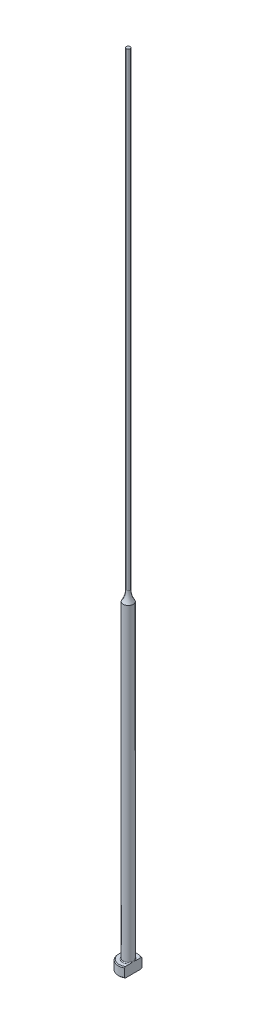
ISO-10303-21;
HEADER;
FILE_DESCRIPTION(('STEP AP214'),'2;1');
FILE_NAME('part.step','',(''),(''),'','','');
FILE_SCHEMA(('AUTOMOTIVE_DESIGN { 1 0 10303 214 1 1 1 1 }'));
ENDSEC;
DATA;
#1=APPLICATION_CONTEXT('core data for automotive mechanical design processes');
#2=APPLICATION_PROTOCOL_DEFINITION('international standard','automotive_design',2000,#1);
#3=PRODUCT_CONTEXT('',#1,'mechanical');
#4=PRODUCT('Part','Part','',(#3));
#5=PRODUCT_RELATED_PRODUCT_CATEGORY('part','',(#4));
#6=PRODUCT_DEFINITION_FORMATION('','',#4);
#7=PRODUCT_DEFINITION_CONTEXT('part definition',#1,'design');
#8=PRODUCT_DEFINITION('design','',#6,#7);
#9=PRODUCT_DEFINITION_SHAPE('','',#8);
#10=(LENGTH_UNIT() NAMED_UNIT(*) SI_UNIT(.MILLI.,.METRE.));
#11=(NAMED_UNIT(*) PLANE_ANGLE_UNIT() SI_UNIT($,.RADIAN.));
#12=(NAMED_UNIT(*) SI_UNIT($,.STERADIAN.) SOLID_ANGLE_UNIT());
#13=UNCERTAINTY_MEASURE_WITH_UNIT(LENGTH_MEASURE(1.E-05),#10,'distance_accuracy_value','');
#14=(GEOMETRIC_REPRESENTATION_CONTEXT(3) GLOBAL_UNCERTAINTY_ASSIGNED_CONTEXT((#13)) GLOBAL_UNIT_ASSIGNED_CONTEXT((#10,
#11,#12)) REPRESENTATION_CONTEXT('',''));
#15=CARTESIAN_POINT('',(0.,0.,0.));
#16=DIRECTION('',(0.,0.,1.));
#17=DIRECTION('',(1.,0.,0.));
#18=AXIS2_PLACEMENT_3D('',#15,#16,#17);
#19=CARTESIAN_POINT('',(-3.17499999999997,3.175,0.));
#20=DIRECTION('',(0.,1.,0.));
#21=DIRECTION('',(0.,0.,1.));
#22=AXIS2_PLACEMENT_3D('',#19,#20,#21);
#23=PLANE('',#22);
#24=CARTESIAN_POINT('',(0.,3.175,0.));
#25=DIRECTION('',(0.,1.,0.));
#26=DIRECTION('',(0.,0.,1.));
#27=AXIS2_PLACEMENT_3D('',#24,#25,#26);
#28=CIRCLE('',#27,2.92099999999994);
#29=CARTESIAN_POINT('',(1.58749999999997,3.175,-2.45195529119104));
#30=VERTEX_POINT('',#29);
#31=CARTESIAN_POINT('',(1.58749999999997,3.175,2.45195529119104));
#32=VERTEX_POINT('',#31);
#33=EDGE_CURVE('E105',#30,#32,#28,.T.);
#34=ORIENTED_EDGE('',*,*,#33,.T.);
#35=DIRECTION('',(0.,0.,1.));
#36=VECTOR('',#35,1.);
#37=CARTESIAN_POINT('',(1.58749999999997,3.17499999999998,2.74963065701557));
#38=LINE('',#37,#36);
#39=CARTESIAN_POINT('',(1.58749999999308,3.175,0.933255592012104));
#40=VERTEX_POINT('',#39);
#41=EDGE_CURVE('E126',#40,#32,#38,.T.);
#42=ORIENTED_EDGE('',*,*,#41,.F.);
#43=CARTESIAN_POINT('',(0.,3.175,0.));
#44=DIRECTION('',(0.,1.,0.));
#45=DIRECTION('',(0.,0.,1.));
#46=AXIS2_PLACEMENT_3D('',#43,#44,#45);
#47=CIRCLE('',#46,1.84149999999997);
#48=CARTESIAN_POINT('',(1.58749999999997,3.17500000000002,-0.933255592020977));
#49=VERTEX_POINT('',#48);
#50=EDGE_CURVE('E11',#40,#49,#47,.F.);
#51=ORIENTED_EDGE('',*,*,#50,.T.);
#52=EDGE_CURVE('E52',#30,#49,#38,.T.);
#53=ORIENTED_EDGE('',*,*,#52,.F.);
#54=EDGE_LOOP('',(#34,#42,#51,#53));
#55=FACE_BOUND('',#54,.T.);
#56=ADVANCED_FACE('F32',(#55),#23,.T.);
#57=CARTESIAN_POINT('',(0.,259.958771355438,0.));
#58=DIRECTION('',(0.,1.,0.));
#59=DIRECTION('',(0.,0.,1.));
#60=AXIS2_PLACEMENT_3D('',#57,#58,#59);
#61=CYLINDRICAL_SURFACE('',#60,3.17499999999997);
#62=CARTESIAN_POINT('',(0.,2.92100000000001,0.));
#63=DIRECTION('',(0.,1.,0.));
#64=DIRECTION('',(0.,0.,1.));
#65=AXIS2_PLACEMENT_3D('',#62,#63,#64);
#66=CIRCLE('',#65,3.17499999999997);
#67=CARTESIAN_POINT('',(1.58749999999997,2.92100000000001,2.74963065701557));
#68=VERTEX_POINT('',#67);
#69=CARTESIAN_POINT('',(1.58749999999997,2.92100000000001,-2.74963065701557));
#70=VERTEX_POINT('',#69);
#71=EDGE_CURVE('E98',#68,#70,#66,.F.);
#72=ORIENTED_EDGE('',*,*,#71,.T.);
#73=DIRECTION('',(0.,-1.,0.));
#74=VECTOR('',#73,1.);
#75=CARTESIAN_POINT('',(1.58749999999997,254.001,-2.74963065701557));
#76=LINE('',#75,#74);
#77=CARTESIAN_POINT('',(1.58749999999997,0.253999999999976,-2.74963065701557));
#78=VERTEX_POINT('',#77);
#79=EDGE_CURVE('E141',#70,#78,#76,.T.);
#80=ORIENTED_EDGE('',*,*,#79,.T.);
#81=CARTESIAN_POINT('',(0.,0.253999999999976,0.));
#82=DIRECTION('',(0.,-1.,0.));
#83=DIRECTION('',(0.,0.,-1.));
#84=AXIS2_PLACEMENT_3D('',#81,#82,#83);
#85=CIRCLE('',#84,3.17499999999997);
#86=CARTESIAN_POINT('',(1.58749999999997,0.253999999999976,2.74963065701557));
#87=VERTEX_POINT('',#86);
#88=EDGE_CURVE('E95',#78,#87,#85,.F.);
#89=ORIENTED_EDGE('',*,*,#88,.T.);
#90=DIRECTION('',(0.,-1.,0.));
#91=VECTOR('',#90,1.);
#92=CARTESIAN_POINT('',(1.58749999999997,254.001,2.74963065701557));
#93=LINE('',#92,#91);
#94=EDGE_CURVE('E88',#68,#87,#93,.T.);
#95=ORIENTED_EDGE('',*,*,#94,.F.);
#96=EDGE_LOOP('',(#72,#80,#89,#95));
#97=FACE_BOUND('',#96,.T.);
#98=ADVANCED_FACE('F191',(#97),#61,.T.);
#99=CARTESIAN_POINT('',(0.,0.,0.));
#100=DIRECTION('',(0.,-1.,0.));
#101=DIRECTION('',(0.,0.,-1.));
#102=AXIS2_PLACEMENT_3D('',#99,#100,#101);
#103=PLANE('',#102);
#104=CARTESIAN_POINT('',(0.,0.,0.));
#105=DIRECTION('',(0.,-1.,0.));
#106=DIRECTION('',(0.,0.,-1.));
#107=AXIS2_PLACEMENT_3D('',#104,#105,#106);
#108=CIRCLE('',#107,2.92100000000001);
#109=CARTESIAN_POINT('',(1.58749999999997,0.,2.45195529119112));
#110=VERTEX_POINT('',#109);
#111=CARTESIAN_POINT('',(1.58749999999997,0.,-2.45195529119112));
#112=VERTEX_POINT('',#111);
#113=EDGE_CURVE('E93',#110,#112,#108,.T.);
#114=ORIENTED_EDGE('',*,*,#113,.T.);
#115=DIRECTION('',(0.,0.,1.));
#116=VECTOR('',#115,1.);
#117=CARTESIAN_POINT('',(1.58749999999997,0.,2.74963065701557));
#118=LINE('',#117,#116);
#119=EDGE_CURVE('E78',#112,#110,#118,.T.);
#120=ORIENTED_EDGE('',*,*,#119,.T.);
#121=EDGE_LOOP('',(#114,#120));
#122=FACE_BOUND('',#121,.T.);
#123=ADVANCED_FACE('F97',(#122),#103,.T.);
#124=CARTESIAN_POINT('',(0.,3.17499999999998,0.));
#125=DIRECTION('',(0.,-1.,0.));
#126=DIRECTION('',(0.,0.,-1.));
#127=AXIS2_PLACEMENT_3D('',#124,#125,#126);
#128=CONICAL_SURFACE('',#127,2.92099999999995,0.785398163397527);
#129=ORIENTED_EDGE('',*,*,#71,.F.);
#130=CARTESIAN_POINT('',(1.58749999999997,-0.16162066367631,-6.0529050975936));
#131=CARTESIAN_POINT('',(1.58749999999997,-0.0288893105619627,-5.91567682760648));
#132=CARTESIAN_POINT('',(1.58749999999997,0.103699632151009,-5.7783103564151));
#133=CARTESIAN_POINT('',(1.58749999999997,0.368508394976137,-5.50321874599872));
#134=CARTESIAN_POINT('',(1.58749999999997,0.500728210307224,-5.36549360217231));
#135=CARTESIAN_POINT('',(1.58749999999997,0.764778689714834,-5.08953516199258));
#136=CARTESIAN_POINT('',(1.58749999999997,0.896609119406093,-4.9513016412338));
#137=CARTESIAN_POINT('',(1.58749999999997,1.15968706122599,-4.67428233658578));
#138=CARTESIAN_POINT('',(1.58749999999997,1.29093457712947,-4.53549655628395));
#139=CARTESIAN_POINT('',(1.58749999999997,1.55007705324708,-4.25997724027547));
#140=CARTESIAN_POINT('',(1.58749999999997,1.67798684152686,-4.12325766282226));
#141=CARTESIAN_POINT('',(1.58749999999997,1.9328486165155,-3.84892898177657));
#142=CARTESIAN_POINT('',(1.58749999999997,2.05980060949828,-3.71131988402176));
#143=CARTESIAN_POINT('',(1.58749999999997,2.31237508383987,-3.43493978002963));
#144=CARTESIAN_POINT('',(1.58749999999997,2.43799784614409,-3.29616903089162));
#145=CARTESIAN_POINT('',(1.58749999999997,2.68741369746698,-3.01699558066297));
#146=CARTESIAN_POINT('',(1.58749999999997,2.81120686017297,-2.8765929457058));
#147=CARTESIAN_POINT('',(1.58749999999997,3.00875865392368,-2.64816703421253));
#148=CARTESIAN_POINT('',(1.58749999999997,3.08336151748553,-2.56087478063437));
#149=CARTESIAN_POINT('',(1.58749999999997,3.2312387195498,-2.38515423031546));
#150=CARTESIAN_POINT('',(1.58749999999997,3.30451292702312,-2.29672582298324));
#151=CARTESIAN_POINT('',(1.58749999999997,3.45004422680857,-2.1174740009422));
#152=CARTESIAN_POINT('',(1.58749999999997,3.5222823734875,-2.02663514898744));
#153=CARTESIAN_POINT('',(1.58749999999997,3.66423097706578,-1.8430252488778));
#154=CARTESIAN_POINT('',(1.58749999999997,3.73394203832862,-1.75025467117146));
#155=CARTESIAN_POINT('',(1.58749999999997,3.87080633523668,-1.5606747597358));
#156=CARTESIAN_POINT('',(1.58749999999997,3.93790459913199,-1.46382547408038));
#157=CARTESIAN_POINT('',(1.58749999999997,4.06669147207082,-1.26632594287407));
#158=CARTESIAN_POINT('',(1.58749999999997,4.1283726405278,-1.16567073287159));
#159=CARTESIAN_POINT('',(1.58749999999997,4.21402252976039,-1.01165766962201));
#160=CARTESIAN_POINT('',(1.58749999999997,4.24127929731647,-0.960142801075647));
#161=CARTESIAN_POINT('',(1.58749999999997,4.2930979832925,-0.855780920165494));
#162=CARTESIAN_POINT('',(1.58749999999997,4.31765941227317,-0.802933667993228));
#163=CARTESIAN_POINT('',(1.58749999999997,4.38614656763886,-0.642461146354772));
#164=CARTESIAN_POINT('',(1.58749999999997,4.42510149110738,-0.532518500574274));
#165=CARTESIAN_POINT('',(1.58749999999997,4.46726244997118,-0.367680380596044));
#166=CARTESIAN_POINT('',(1.58749999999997,4.47844427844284,-0.314802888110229));
#167=CARTESIAN_POINT('',(1.58749999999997,4.49576654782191,-0.208209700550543));
#168=CARTESIAN_POINT('',(1.58749999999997,4.50190743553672,-0.154494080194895));
#169=CARTESIAN_POINT('',(1.58749999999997,4.50871296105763,-0.0468792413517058));
#170=CARTESIAN_POINT('',(1.58749999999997,4.5093945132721,0.00701889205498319));
#171=CARTESIAN_POINT('',(1.58749999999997,4.50527679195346,0.114606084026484));
#172=CARTESIAN_POINT('',(1.58749999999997,4.50047706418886,0.168295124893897));
#173=CARTESIAN_POINT('',(1.58749999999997,4.48579689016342,0.27448544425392));
#174=CARTESIAN_POINT('',(1.58749999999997,4.47596081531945,0.32699298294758));
#175=CARTESIAN_POINT('',(1.58749999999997,4.45181809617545,0.430974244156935));
#176=CARTESIAN_POINT('',(1.58749999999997,4.4375096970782,0.482447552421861));
#177=CARTESIAN_POINT('',(1.58749999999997,4.40502489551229,0.584460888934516));
#178=CARTESIAN_POINT('',(1.58749999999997,4.386827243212,0.634994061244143));
#179=CARTESIAN_POINT('',(1.58749999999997,4.34729308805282,0.734789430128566));
#180=CARTESIAN_POINT('',(1.58749999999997,4.3259572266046,0.784051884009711));
#181=CARTESIAN_POINT('',(1.58749999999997,4.25791922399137,0.930549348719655));
#182=CARTESIAN_POINT('',(1.58749999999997,4.20736047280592,1.0259880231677));
#183=CARTESIAN_POINT('',(1.58749999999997,4.0995545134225,1.21304313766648));
#184=CARTESIAN_POINT('',(1.58749999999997,4.04229912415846,1.30465471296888));
#185=CARTESIAN_POINT('',(1.58749999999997,3.92308746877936,1.48526211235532));
#186=CARTESIAN_POINT('',(1.58749999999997,3.86111349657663,1.57424615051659));
#187=CARTESIAN_POINT('',(1.58749999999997,3.73408621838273,1.74990003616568));
#188=CARTESIAN_POINT('',(1.58749999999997,3.66903444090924,1.83657099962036));
#189=CARTESIAN_POINT('',(1.58749999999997,3.53583371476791,2.00931764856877));
#190=CARTESIAN_POINT('',(1.58749999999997,3.46765527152,2.09537048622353));
#191=CARTESIAN_POINT('',(1.58749999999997,3.32960643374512,2.26611736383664));
#192=CARTESIAN_POINT('',(1.58749999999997,3.25973586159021,2.35081125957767));
#193=CARTESIAN_POINT('',(1.58749999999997,3.04858139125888,2.60290121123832));
#194=CARTESIAN_POINT('',(1.58749999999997,2.90542388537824,2.76872537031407));
#195=CARTESIAN_POINT('',(1.58749999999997,2.64069522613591,3.06970913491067));
#196=CARTESIAN_POINT('',(1.58749999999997,2.51959458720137,3.20528660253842));
#197=CARTESIAN_POINT('',(1.58749999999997,2.27590400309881,3.47510321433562));
#198=CARTESIAN_POINT('',(1.58749999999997,2.15331401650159,3.60934232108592));
#199=CARTESIAN_POINT('',(1.58749999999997,1.90694239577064,3.87695374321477));
#200=CARTESIAN_POINT('',(1.58749999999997,1.78315974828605,4.0103251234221));
#201=CARTESIAN_POINT('',(1.58749999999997,1.53478104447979,4.27630880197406));
#202=CARTESIAN_POINT('',(1.58749999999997,1.41018498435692,4.40892109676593));
#203=CARTESIAN_POINT('',(1.58749999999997,1.0457468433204,4.79499418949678));
#204=CARTESIAN_POINT('',(1.58749999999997,0.80507680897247,5.04767313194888));
#205=CARTESIAN_POINT('',(1.58749999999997,0.443121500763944,5.42550911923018));
#206=CARTESIAN_POINT('',(1.58749999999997,0.322378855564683,5.55118772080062));
#207=CARTESIAN_POINT('',(1.58749999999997,0.0805914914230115,5.80225207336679));
#208=CARTESIAN_POINT('',(1.58749999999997,-0.040453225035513,5.92763782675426));
#209=CARTESIAN_POINT('',(1.58749999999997,-0.161620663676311,6.0529050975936));
#210=B_SPLINE_CURVE_WITH_KNOTS('',3,(#130,#131,#132,#133,#134,#135,#136,#137,#138,#139,#140,
#141,#142,#143,#144,#145,#146,#147,#148,#149,#150,#151,#152,#153,#154,#155,#156,#157,#158,#159,
#160,#161,#162,#163,#164,#165,#166,#167,#168,#169,#170,#171,#172,#173,#174,#175,#176,#177,#178,
#179,#180,#181,#182,#183,#184,#185,#186,#187,#188,#189,#190,#191,#192,#193,#194,#195,#196,#197,
#198,#199,#200,#201,#202,#203,#204,#205,#206,#207,#208,#209),.UNSPECIFIED.,.F.,.F.,(4,2,2,2,2,2,
2,2,2,2,2,2,2,2,2,2,2,2,2,2,2,2,2,2,2,2,2,2,2,2,2,2,2,2,2,2,2,2,2,4),(0.,0.572750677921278,
1.14550874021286,1.71856057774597,2.29160869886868,2.85328006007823,3.4149477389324,
3.97649423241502,4.53801804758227,4.88249307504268,5.22700189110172,5.5751532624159,
5.92322081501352,6.27657800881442,6.63041319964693,6.80518126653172,6.9799810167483,
7.3282426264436,7.49018491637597,7.65211285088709,7.81353889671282,7.97497832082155,
8.13501929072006,8.29512313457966,8.45612518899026,8.61709438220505,8.94062993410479,
9.2645649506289,9.58978187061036,9.91483894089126,10.2441741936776,10.5735441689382,
11.2306812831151,11.7760337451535,12.3214014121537,12.8672825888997,13.4131663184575,
14.4600164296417,14.9828595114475,15.5056983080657),.UNSPECIFIED.);
#211=EDGE_CURVE('E118',#32,#68,#210,.T.);
#212=ORIENTED_EDGE('',*,*,#211,.F.);
#213=ORIENTED_EDGE('',*,*,#33,.F.);
#214=EDGE_CURVE('E117',#70,#30,#210,.T.);
#215=ORIENTED_EDGE('',*,*,#214,.F.);
#216=EDGE_LOOP('',(#129,#212,#213,#215));
#217=FACE_BOUND('',#216,.T.);
#218=ADVANCED_FACE('F162',(#217),#128,.T.);
#219=CARTESIAN_POINT('',(0.,0.253999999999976,0.));
#220=DIRECTION('',(0.,1.,0.));
#221=DIRECTION('',(0.,0.,1.));
#222=AXIS2_PLACEMENT_3D('',#219,#220,#221);
#223=CONICAL_SURFACE('',#222,3.17499999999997,0.785398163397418);
#224=ORIENTED_EDGE('',*,*,#88,.F.);
#225=CARTESIAN_POINT('',(1.58749999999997,3.33662066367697,6.0529050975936));
#226=CARTESIAN_POINT('',(1.58749999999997,3.20388931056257,5.91567682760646));
#227=CARTESIAN_POINT('',(1.58749999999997,3.07130036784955,5.77831035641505));
#228=CARTESIAN_POINT('',(1.58749999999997,2.80649160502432,5.50321874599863));
#229=CARTESIAN_POINT('',(1.58749999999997,2.67427178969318,5.3654936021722));
#230=CARTESIAN_POINT('',(1.58749999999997,2.41022131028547,5.08953516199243));
#231=CARTESIAN_POINT('',(1.58749999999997,2.27839088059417,4.95130164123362));
#232=CARTESIAN_POINT('',(1.58749999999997,2.01531293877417,4.67428233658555));
#233=CARTESIAN_POINT('',(1.58749999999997,1.88406542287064,4.5354965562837));
#234=CARTESIAN_POINT('',(1.58749999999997,1.62492294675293,4.25997724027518));
#235=CARTESIAN_POINT('',(1.58749999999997,1.49701315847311,4.12325766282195));
#236=CARTESIAN_POINT('',(1.58749999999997,1.24215138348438,3.84892898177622));
#237=CARTESIAN_POINT('',(1.58749999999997,1.11519939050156,3.71131988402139));
#238=CARTESIAN_POINT('',(1.58749999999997,0.862624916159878,3.43493978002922));
#239=CARTESIAN_POINT('',(1.58749999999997,0.737002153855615,3.29616903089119));
#240=CARTESIAN_POINT('',(1.58749999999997,0.487586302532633,3.01699558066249));
#241=CARTESIAN_POINT('',(1.58749999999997,0.363793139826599,2.8765929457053));
#242=CARTESIAN_POINT('',(1.58749999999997,0.166241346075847,2.64816703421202));
#243=CARTESIAN_POINT('',(1.58749999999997,0.0916384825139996,2.56087478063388));
#244=CARTESIAN_POINT('',(1.58749999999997,-0.0562387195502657,2.385154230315));
#245=CARTESIAN_POINT('',(1.58749999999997,-0.129512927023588,2.29672582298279));
#246=CARTESIAN_POINT('',(1.58749999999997,-0.27504422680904,2.11747400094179));
#247=CARTESIAN_POINT('',(1.58749999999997,-0.347282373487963,2.02663514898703));
#248=CARTESIAN_POINT('',(1.58749999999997,-0.489230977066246,1.84302524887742));
#249=CARTESIAN_POINT('',(1.58749999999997,-0.558942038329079,1.7502546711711));
#250=CARTESIAN_POINT('',(1.58749999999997,-0.695806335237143,1.56067475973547));
#251=CARTESIAN_POINT('',(1.58749999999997,-0.762904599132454,1.46382547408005));
#252=CARTESIAN_POINT('',(1.58749999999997,-0.891691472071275,1.26632594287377));
#253=CARTESIAN_POINT('',(1.58749999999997,-0.953372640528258,1.16567073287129));
#254=CARTESIAN_POINT('',(1.58749999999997,-1.03902252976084,1.01165766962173));
#255=CARTESIAN_POINT('',(1.58749999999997,-1.06627929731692,0.960142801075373));
#256=CARTESIAN_POINT('',(1.58749999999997,-1.11809798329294,0.85578092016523));
#257=CARTESIAN_POINT('',(1.58749999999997,-1.14265941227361,0.802933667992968));
#258=CARTESIAN_POINT('',(1.58749999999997,-1.21114656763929,0.642461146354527));
#259=CARTESIAN_POINT('',(1.58749999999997,-1.2501014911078,0.532518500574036));
#260=CARTESIAN_POINT('',(1.58749999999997,-1.29226244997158,0.367680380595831));
#261=CARTESIAN_POINT('',(1.58749999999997,-1.30344427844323,0.314802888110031));
#262=CARTESIAN_POINT('',(1.58749999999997,-1.32076654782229,0.208209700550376));
#263=CARTESIAN_POINT('',(1.58749999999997,-1.3269074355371,0.154494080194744));
#264=CARTESIAN_POINT('',(1.58749999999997,-1.333712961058,0.0468792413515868));
#265=CARTESIAN_POINT('',(1.58749999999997,-1.33439451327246,-0.00701889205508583));
#266=CARTESIAN_POINT('',(1.58749999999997,-1.33027679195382,-0.114606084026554));
#267=CARTESIAN_POINT('',(1.58749999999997,-1.32547706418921,-0.168295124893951));
#268=CARTESIAN_POINT('',(1.58749999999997,-1.31079689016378,-0.274485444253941));
#269=CARTESIAN_POINT('',(1.58749999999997,-1.3009608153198,-0.326992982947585));
#270=CARTESIAN_POINT('',(1.58749999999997,-1.27681809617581,-0.430974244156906));
#271=CARTESIAN_POINT('',(1.58749999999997,-1.26250969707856,-0.482447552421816));
#272=CARTESIAN_POINT('',(1.58749999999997,-1.23002489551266,-0.584460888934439));
#273=CARTESIAN_POINT('',(1.58749999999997,-1.21182724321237,-0.634994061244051));
#274=CARTESIAN_POINT('',(1.58749999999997,-1.1722930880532,-0.734789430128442));
#275=CARTESIAN_POINT('',(1.58749999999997,-1.15095722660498,-0.784051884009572));
#276=CARTESIAN_POINT('',(1.58749999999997,-1.08291922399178,-0.93054934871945));
#277=CARTESIAN_POINT('',(1.58749999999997,-1.03236047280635,-1.02598802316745));
#278=CARTESIAN_POINT('',(1.58749999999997,-0.924554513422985,-1.21304313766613));
#279=CARTESIAN_POINT('',(1.58749999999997,-0.86729912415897,-1.30465471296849));
#280=CARTESIAN_POINT('',(1.58749999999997,-0.748087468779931,-1.48526211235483));
#281=CARTESIAN_POINT('',(1.58749999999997,-0.686113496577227,-1.57424615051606));
#282=CARTESIAN_POINT('',(1.58749999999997,-0.55908621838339,-1.74990003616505));
#283=CARTESIAN_POINT('',(1.58749999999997,-0.494034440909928,-1.83657099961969));
#284=CARTESIAN_POINT('',(1.58749999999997,-0.360833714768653,-2.00931764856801));
#285=CARTESIAN_POINT('',(1.58749999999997,-0.292655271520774,-2.09537048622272));
#286=CARTESIAN_POINT('',(1.58749999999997,-0.154606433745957,-2.26611736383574));
#287=CARTESIAN_POINT('',(1.58749999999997,-0.0847358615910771,-2.35081125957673));
#288=CARTESIAN_POINT('',(1.58749999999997,0.126418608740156,-2.60290121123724));
#289=CARTESIAN_POINT('',(1.58749999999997,0.269576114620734,-2.76872537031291));
#290=CARTESIAN_POINT('',(1.58749999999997,0.534304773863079,-3.06970913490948));
#291=CARTESIAN_POINT('',(1.58749999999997,0.655405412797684,-3.20528660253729));
#292=CARTESIAN_POINT('',(1.58749999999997,0.899095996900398,-3.47510321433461));
#293=CARTESIAN_POINT('',(1.58749999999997,1.02168598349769,-3.60934232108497));
#294=CARTESIAN_POINT('',(1.58749999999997,1.26805760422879,-3.87695374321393));
#295=CARTESIAN_POINT('',(1.58749999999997,1.39184025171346,-4.01032512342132));
#296=CARTESIAN_POINT('',(1.58749999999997,1.64021895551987,-4.2763088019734));
#297=CARTESIAN_POINT('',(1.58749999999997,1.76481501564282,-4.40892109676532));
#298=CARTESIAN_POINT('',(1.58749999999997,2.12925315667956,-4.79499418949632));
#299=CARTESIAN_POINT('',(1.58749999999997,2.36992319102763,-5.04767313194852));
#300=CARTESIAN_POINT('',(1.58749999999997,2.73187849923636,-5.42550911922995));
#301=CARTESIAN_POINT('',(1.58749999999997,2.85262114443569,-5.55118772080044));
#302=CARTESIAN_POINT('',(1.58749999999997,3.09440850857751,-5.8022520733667));
#303=CARTESIAN_POINT('',(1.58749999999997,3.2154532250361,-5.92763782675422));
#304=CARTESIAN_POINT('',(1.58749999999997,3.33662066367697,-6.0529050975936));
#305=B_SPLINE_CURVE_WITH_KNOTS('',3,(#225,#226,#227,#228,#229,#230,#231,#232,#233,#234,#235,
#236,#237,#238,#239,#240,#241,#242,#243,#244,#245,#246,#247,#248,#249,#250,#251,#252,#253,#254,
#255,#256,#257,#258,#259,#260,#261,#262,#263,#264,#265,#266,#267,#268,#269,#270,#271,#272,#273,
#274,#275,#276,#277,#278,#279,#280,#281,#282,#283,#284,#285,#286,#287,#288,#289,#290,#291,#292,
#293,#294,#295,#296,#297,#298,#299,#300,#301,#302,#303,#304),.UNSPECIFIED.,.F.,.F.,(4,2,2,2,2,2,
2,2,2,2,2,2,2,2,2,2,2,2,2,2,2,2,2,2,2,2,2,2,2,2,2,2,2,2,2,2,2,2,2,4),(0.,0.57275067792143,
1.14550874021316,1.71856057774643,2.29160869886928,2.85328006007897,3.41494773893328,
3.97649423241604,4.53801804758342,4.88249307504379,5.2270018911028,5.57515326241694,
5.92322081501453,6.27657800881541,6.63041319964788,6.80518126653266,6.97998101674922,
7.32824262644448,7.49018491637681,7.65211285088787,7.81353889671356,7.97497832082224,
8.1350192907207,8.29512313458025,8.45612518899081,8.61709438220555,8.94062993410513,
9.26456495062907,9.58978187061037,9.91483894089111,10.2441741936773,10.5735441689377,
11.2306812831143,11.776033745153,12.3214014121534,12.8672825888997,13.4131663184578,
14.4600164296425,14.9828595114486,15.505698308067),.UNSPECIFIED.);
#306=EDGE_CURVE('E81',#112,#78,#305,.T.);
#307=ORIENTED_EDGE('',*,*,#306,.F.);
#308=ORIENTED_EDGE('',*,*,#113,.F.);
#309=EDGE_CURVE('E84',#87,#110,#305,.T.);
#310=ORIENTED_EDGE('',*,*,#309,.F.);
#311=EDGE_LOOP('',(#224,#307,#308,#310));
#312=FACE_BOUND('',#311,.T.);
#313=ADVANCED_FACE('F92',(#312),#223,.T.);
#314=CARTESIAN_POINT('',(0.,3.42900000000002,0.));
#315=DIRECTION('',(0.,1.,0.));
#316=DIRECTION('',(0.,0.,1.));
#317=AXIS2_PLACEMENT_3D('',#314,#315,#316);
#318=TOROIDAL_SURFACE('',#317,1.84149999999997,0.254);
#319=CARTESIAN_POINT('',(1.58749999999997,3.42900000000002,0.));
#320=CARTESIAN_POINT('',(1.58749999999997,3.42899942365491,-1.9220514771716E-10));
#321=CARTESIAN_POINT('',(1.58749999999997,3.42899884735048,-1.2261161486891E-07));
#322=CARTESIAN_POINT('',(1.58749999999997,3.42899773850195,-5.09676365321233E-07));
#323=CARTESIAN_POINT('',(1.58749999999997,3.42899720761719,-7.78176328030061E-07));
#324=CARTESIAN_POINT('',(1.58749999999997,3.42899614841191,-1.42307272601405E-06));
#325=CARTESIAN_POINT('',(1.58749999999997,3.42899562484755,-1.80713867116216E-06));
#326=CARTESIAN_POINT('',(1.58749999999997,3.42899463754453,-2.63494846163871E-06));
#327=CARTESIAN_POINT('',(1.58749999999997,3.42899417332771,-3.07814756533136E-06));
#328=CARTESIAN_POINT('',(1.58749999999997,3.42899261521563,-4.66897357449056E-06));
#329=CARTESIAN_POINT('',(1.58749999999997,3.42899159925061,-5.89404908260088E-06));
#330=CARTESIAN_POINT('',(1.58749999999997,3.42898979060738,-8.42427511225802E-06));
#331=CARTESIAN_POINT('',(1.58749999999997,3.42898899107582,-9.7248057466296E-06));
#332=CARTESIAN_POINT('',(1.58749999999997,3.42898598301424,-1.48060601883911E-05));
#333=CARTESIAN_POINT('',(1.58749999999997,3.42898393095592,-1.86838281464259E-05));
#334=CARTESIAN_POINT('',(1.58749999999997,3.42898057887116,-2.63261117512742E-05));
#335=CARTESIAN_POINT('',(1.58749999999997,3.42897922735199,-3.00687417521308E-05));
#336=CARTESIAN_POINT('',(1.58749999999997,3.42897347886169,-4.60276298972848E-05));
#337=CARTESIAN_POINT('',(1.58749999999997,3.42896911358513,-5.8247019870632E-05));
#338=CARTESIAN_POINT('',(1.58749999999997,3.42896211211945,-8.11070097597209E-05));
#339=CARTESIAN_POINT('',(1.58749999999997,3.42895931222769,-9.16953114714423E-05));
#340=CARTESIAN_POINT('',(1.58749999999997,3.42893712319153,-0.000168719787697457));
#341=CARTESIAN_POINT('',(1.58749999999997,3.42890881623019,-0.000232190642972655));
#342=CARTESIAN_POINT('',(1.58749999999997,3.42880276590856,-0.000479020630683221));
#343=CARTESIAN_POINT('',(1.58749999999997,3.42873165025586,-0.00066443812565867));
#344=CARTESIAN_POINT('',(1.58749999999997,3.42845137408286,-0.0013844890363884));
#345=CARTESIAN_POINT('',(1.58749999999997,3.42823526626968,-0.00191701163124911));
#346=CARTESIAN_POINT('',(1.58749999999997,3.42735449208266,-0.00409774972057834));
#347=CARTESIAN_POINT('',(1.58749999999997,3.42669768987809,-0.00574830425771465));
#348=CARTESIAN_POINT('',(1.58749999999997,3.4174405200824,-0.0289985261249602));
#349=CARTESIAN_POINT('',(1.58749999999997,3.40878325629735,-0.0505816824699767));
#350=CARTESIAN_POINT('',(1.58749999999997,3.39189297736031,-0.0929947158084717));
#351=CARTESIAN_POINT('',(1.58749999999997,3.38365605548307,-0.11382315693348));
#352=CARTESIAN_POINT('',(1.58749999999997,3.36635393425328,-0.157956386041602));
#353=CARTESIAN_POINT('',(1.58749999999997,3.35730391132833,-0.181267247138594));
#354=CARTESIAN_POINT('',(1.58749999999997,3.33936775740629,-0.228222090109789));
#355=CARTESIAN_POINT('',(1.58749999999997,3.33048420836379,-0.25186705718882));
#356=CARTESIAN_POINT('',(1.58749999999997,3.30894496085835,-0.310512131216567));
#357=CARTESIAN_POINT('',(1.58749999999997,3.29649449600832,-0.345588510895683));
#358=CARTESIAN_POINT('',(1.58749999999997,3.27296975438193,-0.415278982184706));
#359=CARTESIAN_POINT('',(1.58749999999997,3.26186987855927,-0.449884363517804));
#360=CARTESIAN_POINT('',(1.58749999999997,3.2395832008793,-0.524471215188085));
#361=CARTESIAN_POINT('',(1.58749999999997,3.22860862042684,-0.564517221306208));
#362=CARTESIAN_POINT('',(1.58749999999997,3.20902534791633,-0.645529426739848));
#363=CARTESIAN_POINT('',(1.58749999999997,3.20043582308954,-0.686500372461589));
#364=CARTESIAN_POINT('',(1.58749999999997,3.18611712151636,-0.771546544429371));
#365=CARTESIAN_POINT('',(1.58749999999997,3.18059550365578,-0.815658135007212));
#366=CARTESIAN_POINT('',(1.58749999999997,3.17455396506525,-0.904117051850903));
#367=CARTESIAN_POINT('',(1.58749999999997,3.17401361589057,-0.948462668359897));
#368=CARTESIAN_POINT('',(1.58749999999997,3.17898948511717,-1.02531896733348));
#369=CARTESIAN_POINT('',(1.58749999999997,3.1829739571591,-1.05792141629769));
#370=CARTESIAN_POINT('',(1.58749999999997,3.19569167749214,-1.12184393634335));
#371=CARTESIAN_POINT('',(1.58749999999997,3.20436049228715,-1.1531753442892));
#372=CARTESIAN_POINT('',(1.58749999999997,3.22236152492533,-1.19946468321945));
#373=CARTESIAN_POINT('',(1.58749999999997,3.2295150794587,-1.21526783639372));
#374=CARTESIAN_POINT('',(1.58749999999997,3.24587062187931,-1.24583726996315));
#375=CARTESIAN_POINT('',(1.58749999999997,3.25507530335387,-1.26060215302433));
#376=CARTESIAN_POINT('',(1.58749999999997,3.27378481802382,-1.28575815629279));
#377=CARTESIAN_POINT('',(1.58749999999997,3.28289001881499,-1.29644383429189));
#378=CARTESIAN_POINT('',(1.58749999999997,3.30268460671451,-1.31623154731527));
#379=CARTESIAN_POINT('',(1.58749999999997,3.31337067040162,-1.32533681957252));
#380=CARTESIAN_POINT('',(1.58749999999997,3.33349977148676,-1.33941140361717));
#381=CARTESIAN_POINT('',(1.58749999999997,3.34261446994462,-1.34484814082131));
#382=CARTESIAN_POINT('',(1.58749999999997,3.36161455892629,-1.35416329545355));
#383=CARTESIAN_POINT('',(1.58749999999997,3.37149946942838,-1.35804267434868));
#384=CARTESIAN_POINT('',(1.58749999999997,3.39188678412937,-1.36398436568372));
#385=CARTESIAN_POINT('',(1.58749999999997,3.40239309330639,-1.36603350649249));
#386=CARTESIAN_POINT('',(1.58749999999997,3.42360372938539,-1.3680840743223));
#387=CARTESIAN_POINT('',(1.58749999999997,3.43430795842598,-1.36808648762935));
#388=CARTESIAN_POINT('',(1.58749999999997,3.45433283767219,-1.36616208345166));
#389=CARTESIAN_POINT('',(1.58749999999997,3.46367506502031,-1.36444960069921));
#390=CARTESIAN_POINT('',(1.58749999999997,3.48195519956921,-1.35953338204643));
#391=CARTESIAN_POINT('',(1.58749999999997,3.49089304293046,-1.3563294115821));
#392=CARTESIAN_POINT('',(1.58749999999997,3.50850302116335,-1.34848006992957));
#393=CARTESIAN_POINT('',(1.58749999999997,3.5171531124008,-1.34378578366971));
#394=CARTESIAN_POINT('',(1.58749999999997,3.53371257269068,-1.33324445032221));
#395=CARTESIAN_POINT('',(1.58749999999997,3.54162163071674,-1.32739692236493));
#396=CARTESIAN_POINT('',(1.58749999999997,3.56107121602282,-1.31107304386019));
#397=CARTESIAN_POINT('',(1.58749999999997,3.57202221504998,-1.29989286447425));
#398=CARTESIAN_POINT('',(1.58749999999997,3.59202509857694,-1.27593566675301));
#399=CARTESIAN_POINT('',(1.58749999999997,3.60107086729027,-1.26315370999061));
#400=CARTESIAN_POINT('',(1.58749999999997,3.62186023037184,-1.22930733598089));
#401=CARTESIAN_POINT('',(1.58749999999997,3.63240584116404,-1.20751096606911));
#402=CARTESIAN_POINT('',(1.58749999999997,3.65004643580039,-1.16266144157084));
#403=CARTESIAN_POINT('',(1.58749999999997,3.65714435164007,-1.13960937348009));
#404=CARTESIAN_POINT('',(1.58749999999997,3.67265428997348,-1.07603916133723));
#405=CARTESIAN_POINT('',(1.58749999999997,3.67834921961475,-1.03486686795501));
#406=CARTESIAN_POINT('',(1.58749999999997,3.68382880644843,-0.951558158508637));
#407=CARTESIAN_POINT('',(1.58749999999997,3.68350976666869,-0.909417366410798));
#408=CARTESIAN_POINT('',(1.58749999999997,3.67745397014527,-0.811383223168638));
#409=CARTESIAN_POINT('',(1.58749999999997,3.66993873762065,-0.755610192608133));
#410=CARTESIAN_POINT('',(1.58749999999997,3.64933373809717,-0.644937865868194));
#411=CARTESIAN_POINT('',(1.58749999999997,3.63621897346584,-0.59004364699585));
#412=CARTESIAN_POINT('',(1.58749999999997,3.60740922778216,-0.485757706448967));
#413=CARTESIAN_POINT('',(1.58749999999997,3.59201096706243,-0.436281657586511));
#414=CARTESIAN_POINT('',(1.58749999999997,3.55922497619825,-0.338551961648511));
#415=CARTESIAN_POINT('',(1.58749999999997,3.5418584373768,-0.290291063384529));
#416=CARTESIAN_POINT('',(1.58749999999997,3.51760237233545,-0.225557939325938));
#417=CARTESIAN_POINT('',(1.58749999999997,3.51126413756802,-0.208874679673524));
#418=CARTESIAN_POINT('',(1.58749999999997,3.49830042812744,-0.17512392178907));
#419=CARTESIAN_POINT('',(1.58749999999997,3.49167176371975,-0.158057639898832));
#420=CARTESIAN_POINT('',(1.58749999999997,3.47585523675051,-0.117638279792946));
#421=CARTESIAN_POINT('',(1.58749999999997,3.46662970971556,-0.0943002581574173));
#422=CARTESIAN_POINT('',(1.58749999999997,3.44889695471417,-0.0497824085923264));
#423=CARTESIAN_POINT('',(1.58749999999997,3.44040039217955,-0.028598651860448));
#424=CARTESIAN_POINT('',(1.58749999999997,3.43130364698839,-0.00575168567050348));
#425=CARTESIAN_POINT('',(1.58749999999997,3.43064818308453,-0.00410451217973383));
#426=CARTESIAN_POINT('',(1.58749999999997,3.42976776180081,-0.00192459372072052));
#427=CARTESIAN_POINT('',(1.58749999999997,3.42955062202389,-0.00138952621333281));
#428=CARTESIAN_POINT('',(1.58749999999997,3.42926908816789,-0.000666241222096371));
#429=CARTESIAN_POINT('',(1.58749999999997,3.42919771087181,-0.000480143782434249));
#430=CARTESIAN_POINT('',(1.58749999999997,3.42909131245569,-0.000232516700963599));
#431=CARTESIAN_POINT('',(1.58749999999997,3.42906294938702,-0.000168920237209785));
#432=CARTESIAN_POINT('',(1.58749999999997,3.42904072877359,-9.17527162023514E-05));
#433=CARTESIAN_POINT('',(1.58749999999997,3.42903792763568,-8.11550293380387E-05));
#434=CARTESIAN_POINT('',(1.58749999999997,3.42903091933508,-5.82743948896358E-05));
#435=CARTESIAN_POINT('',(1.58749999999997,3.42902654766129,-4.60440001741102E-05));
#436=CARTESIAN_POINT('',(1.58749999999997,3.42902079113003,-3.00727682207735E-05));
#437=CARTESIAN_POINT('',(1.58749999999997,3.42901943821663,-2.63286807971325E-05));
#438=CARTESIAN_POINT('',(1.58749999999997,3.42901608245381,-1.86836529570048E-05));
#439=CARTESIAN_POINT('',(1.58749999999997,3.4290140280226,-1.48046517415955E-05));
#440=CARTESIAN_POINT('',(1.58749999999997,3.42901101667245,-9.72223943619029E-06));
#441=CARTESIAN_POINT('',(1.58749999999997,3.42901021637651,-8.42159649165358E-06));
#442=CARTESIAN_POINT('',(1.58749999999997,3.42900840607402,-5.89129729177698E-06));
#443=CARTESIAN_POINT('',(1.58749999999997,3.42900738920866,-4.66626867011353E-06));
#444=CARTESIAN_POINT('',(1.58749999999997,3.42900582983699,-3.07568803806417E-06));
#445=CARTESIAN_POINT('',(1.58749999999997,3.42900536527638,-2.63259565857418E-06));
#446=CARTESIAN_POINT('',(1.58749999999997,3.4290043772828,-1.80506085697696E-06));
#447=CARTESIAN_POINT('',(1.58749999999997,3.42900385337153,-1.42116387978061E-06));
#448=CARTESIAN_POINT('',(1.58749999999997,3.42900279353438,-7.76675643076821E-07));
#449=CARTESIAN_POINT('',(1.58749999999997,3.42900226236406,-5.08406487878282E-07));
#450=CARTESIAN_POINT('',(1.58749999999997,3.42900115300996,-1.21901887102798E-07));
#451=CARTESIAN_POINT('',(1.58749999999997,3.42900057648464,1.92251677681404E-10));
#452=CARTESIAN_POINT('',(1.58749999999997,3.42900000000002,0.));
#453=B_SPLINE_CURVE_WITH_KNOTS('',3,(#319,#320,#321,#322,#323,#324,#325,#326,#327,#328,#329,
#330,#331,#332,#333,#334,#335,#336,#337,#338,#339,#340,#341,#342,#343,#344,#345,#346,#347,#348,
#349,#350,#351,#352,#353,#354,#355,#356,#357,#358,#359,#360,#361,#362,#363,#364,#365,#366,#367,
#368,#369,#370,#371,#372,#373,#374,#375,#376,#377,#378,#379,#380,#381,#382,#383,#384,#385,#386,
#387,#388,#389,#390,#391,#392,#393,#394,#395,#396,#397,#398,#399,#400,#401,#402,#403,#404,#405,
#406,#407,#408,#409,#410,#411,#412,#413,#414,#415,#416,#417,#418,#419,#420,#421,#422,#423,#424,
#425,#426,#427,#428,#429,#430,#431,#432,#433,#434,#435,#436,#437,#438,#439,#440,#441,#442,#443,
#444,#445,#446,#447,#448,#449,#450,#451,#452),.UNSPECIFIED.,.T.,.F.,(4,2,2,2,2,2,2,2,2,2,2,2,2,
2,2,2,2,2,2,2,2,2,2,2,2,2,2,2,2,2,2,2,2,2,2,2,2,2,2,2,2,2,2,2,2,2,2,2,2,2,2,2,2,2,2,2,2,2,2,2,2,
2,2,2,2,2,4),(0.,1.72815458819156E-06,3.50429255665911E-06,5.44431004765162E-06,
7.3675525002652E-06,1.2119089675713E-05,1.66953775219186E-05,2.98160400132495E-05,
4.17409564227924E-05,8.0660475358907E-05,0.000113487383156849,0.000321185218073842,
0.000917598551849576,0.00264089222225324,0.00797105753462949,0.0777276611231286,
0.144923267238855,0.219939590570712,0.295714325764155,0.407362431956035,0.516367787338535,
0.640878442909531,0.766362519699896,0.899536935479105,1.03216495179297,1.13045740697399,
1.22743103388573,1.27935899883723,1.33135556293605,1.37333248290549,1.41522237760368,
1.44693946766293,1.47863694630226,1.51056074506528,1.54246916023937,1.57083210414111,
1.59919951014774,1.62861579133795,1.65804436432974,1.70472658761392,1.75155645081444,
1.82378709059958,1.89595619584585,2.01995471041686,2.1460932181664,2.31447224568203,
2.48361094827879,2.6389891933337,2.79283011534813,2.84637031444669,2.9012946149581,
2.97658236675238,3.04504771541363,3.05036697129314,3.05209849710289,3.05269709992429,
3.05290520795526,3.05293806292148,3.05297701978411,3.05298895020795,3.05300207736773,
3.05300665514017,3.0530114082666,3.05301333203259,3.05301527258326,3.05301704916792,
3.05301877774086),.UNSPECIFIED.);
#454=CARTESIAN_POINT('',(1.58749999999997,3.42900000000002,0.));
#455=VERTEX_POINT('',#454);
#456=EDGE_CURVE('E47',#455,#49,#453,.T.);
#457=ORIENTED_EDGE('',*,*,#456,.T.);
#458=ORIENTED_EDGE('',*,*,#50,.F.);
#459=CARTESIAN_POINT('',(1.58749999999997,3.42900000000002,0.));
#460=CARTESIAN_POINT('',(1.58749999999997,3.42900057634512,1.9220512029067E-10));
#461=CARTESIAN_POINT('',(1.58749999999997,3.42900115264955,1.22611614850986E-07));
#462=CARTESIAN_POINT('',(1.58749999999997,3.42900226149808,5.09676365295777E-07));
#463=CARTESIAN_POINT('',(1.58749999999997,3.42900279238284,7.78176328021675E-07));
#464=CARTESIAN_POINT('',(1.58749999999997,3.42900385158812,1.42307272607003E-06));
#465=CARTESIAN_POINT('',(1.58749999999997,3.42900437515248,1.80713867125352E-06));
#466=CARTESIAN_POINT('',(1.58749999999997,3.4290053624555,2.63494846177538E-06));
#467=CARTESIAN_POINT('',(1.58749999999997,3.42900582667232,3.0781475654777E-06));
#468=CARTESIAN_POINT('',(1.58749999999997,3.4290073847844,4.66897357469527E-06));
#469=CARTESIAN_POINT('',(1.58749999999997,3.42900840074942,5.89404908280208E-06));
#470=CARTESIAN_POINT('',(1.58749999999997,3.42901020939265,8.42427511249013E-06));
#471=CARTESIAN_POINT('',(1.58749999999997,3.42901100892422,9.72480574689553E-06));
#472=CARTESIAN_POINT('',(1.58749999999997,3.42901401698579,1.48060601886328E-05));
#473=CARTESIAN_POINT('',(1.58749999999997,3.42901606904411,1.86838281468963E-05));
#474=CARTESIAN_POINT('',(1.58749999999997,3.42901942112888,2.63261117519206E-05));
#475=CARTESIAN_POINT('',(1.58749999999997,3.42902077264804,3.00687417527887E-05));
#476=CARTESIAN_POINT('',(1.58749999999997,3.42902652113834,4.60276298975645E-05));
#477=CARTESIAN_POINT('',(1.58749999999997,3.4290308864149,5.82470198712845E-05));
#478=CARTESIAN_POINT('',(1.58749999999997,3.42903788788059,8.11070097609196E-05));
#479=CARTESIAN_POINT('',(1.58749999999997,3.42904068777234,9.16953114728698E-05));
#480=CARTESIAN_POINT('',(1.58749999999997,3.4290628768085,0.000168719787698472));
#481=CARTESIAN_POINT('',(1.58749999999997,3.42909118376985,0.000232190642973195));
#482=CARTESIAN_POINT('',(1.58749999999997,3.42919723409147,0.000479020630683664));
#483=CARTESIAN_POINT('',(1.58749999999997,3.42926834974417,0.000664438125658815));
#484=CARTESIAN_POINT('',(1.58749999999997,3.42954862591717,0.00138448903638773));
#485=CARTESIAN_POINT('',(1.58749999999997,3.42976473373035,0.00191701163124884));
#486=CARTESIAN_POINT('',(1.58749999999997,3.43064550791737,0.00409774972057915));
#487=CARTESIAN_POINT('',(1.58749999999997,3.43130231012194,0.00574830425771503));
#488=CARTESIAN_POINT('',(1.58749999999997,3.44055947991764,0.0289985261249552));
#489=CARTESIAN_POINT('',(1.58749999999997,3.44921674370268,0.0505816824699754));
#490=CARTESIAN_POINT('',(1.58749999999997,3.46610702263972,0.0929947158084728));
#491=CARTESIAN_POINT('',(1.58749999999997,3.47434394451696,0.11382315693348));
#492=CARTESIAN_POINT('',(1.58749999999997,3.49164606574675,0.157956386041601));
#493=CARTESIAN_POINT('',(1.58749999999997,3.5006960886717,0.181267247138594));
#494=CARTESIAN_POINT('',(1.58749999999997,3.51863224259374,0.228222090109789));
#495=CARTESIAN_POINT('',(1.58749999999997,3.52751579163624,0.25186705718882));
#496=CARTESIAN_POINT('',(1.58749999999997,3.54905503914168,0.310512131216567));
#497=CARTESIAN_POINT('',(1.58749999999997,3.56150550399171,0.345588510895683));
#498=CARTESIAN_POINT('',(1.58749999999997,3.5850302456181,0.415278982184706));
#499=CARTESIAN_POINT('',(1.58749999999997,3.59613012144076,0.449884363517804));
#500=CARTESIAN_POINT('',(1.58749999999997,3.61841679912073,0.524471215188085));
#501=CARTESIAN_POINT('',(1.58749999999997,3.62939137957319,0.564517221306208));
#502=CARTESIAN_POINT('',(1.58749999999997,3.6489746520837,0.645529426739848));
#503=CARTESIAN_POINT('',(1.58749999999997,3.65756417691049,0.686500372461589));
#504=CARTESIAN_POINT('',(1.58749999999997,3.67188287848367,0.771546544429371));
#505=CARTESIAN_POINT('',(1.58749999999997,3.67740449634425,0.815658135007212));
#506=CARTESIAN_POINT('',(1.58749999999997,3.68344603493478,0.904117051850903));
#507=CARTESIAN_POINT('',(1.58749999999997,3.68398638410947,0.948462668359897));
#508=CARTESIAN_POINT('',(1.58749999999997,3.67901051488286,1.02531896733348));
#509=CARTESIAN_POINT('',(1.58749999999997,3.67502604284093,1.05792141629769));
#510=CARTESIAN_POINT('',(1.58749999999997,3.66230832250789,1.12184393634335));
#511=CARTESIAN_POINT('',(1.58749999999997,3.65363950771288,1.1531753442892));
#512=CARTESIAN_POINT('',(1.58749999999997,3.6356384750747,1.19946468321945));
#513=CARTESIAN_POINT('',(1.58749999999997,3.62848492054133,1.21526783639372));
#514=CARTESIAN_POINT('',(1.58749999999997,3.61212937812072,1.24583726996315));
#515=CARTESIAN_POINT('',(1.58749999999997,3.60292469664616,1.26060215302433));
#516=CARTESIAN_POINT('',(1.58749999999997,3.58421518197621,1.28575815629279));
#517=CARTESIAN_POINT('',(1.58749999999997,3.57510998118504,1.29644383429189));
#518=CARTESIAN_POINT('',(1.58749999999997,3.55531539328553,1.31623154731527));
#519=CARTESIAN_POINT('',(1.58749999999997,3.54462932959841,1.32533681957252));
#520=CARTESIAN_POINT('',(1.58749999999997,3.52450022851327,1.33941140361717));
#521=CARTESIAN_POINT('',(1.58749999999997,3.51538553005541,1.34484814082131));
#522=CARTESIAN_POINT('',(1.58749999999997,3.49638544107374,1.35416329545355));
#523=CARTESIAN_POINT('',(1.58749999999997,3.48650053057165,1.35804267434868));
#524=CARTESIAN_POINT('',(1.58749999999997,3.46611321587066,1.36398436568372));
#525=CARTESIAN_POINT('',(1.58749999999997,3.45560690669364,1.36603350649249));
#526=CARTESIAN_POINT('',(1.58749999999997,3.43439627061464,1.3680840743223));
#527=CARTESIAN_POINT('',(1.58749999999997,3.42369204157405,1.36808648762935));
#528=CARTESIAN_POINT('',(1.58749999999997,3.40366716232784,1.36616208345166));
#529=CARTESIAN_POINT('',(1.58749999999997,3.39432493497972,1.36444960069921));
#530=CARTESIAN_POINT('',(1.58749999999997,3.37604480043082,1.35953338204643));
#531=CARTESIAN_POINT('',(1.58749999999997,3.36710695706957,1.3563294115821));
#532=CARTESIAN_POINT('',(1.58749999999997,3.34949697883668,1.34848006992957));
#533=CARTESIAN_POINT('',(1.58749999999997,3.34084688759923,1.34378578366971));
#534=CARTESIAN_POINT('',(1.58749999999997,3.32428742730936,1.33324445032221));
#535=CARTESIAN_POINT('',(1.58749999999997,3.31637836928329,1.32739692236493));
#536=CARTESIAN_POINT('',(1.58749999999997,3.29692878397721,1.31107304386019));
#537=CARTESIAN_POINT('',(1.58749999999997,3.28597778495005,1.29989286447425));
#538=CARTESIAN_POINT('',(1.58749999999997,3.26597490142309,1.27593566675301));
#539=CARTESIAN_POINT('',(1.58749999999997,3.25692913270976,1.26315370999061));
#540=CARTESIAN_POINT('',(1.58749999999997,3.23613976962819,1.22930733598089));
#541=CARTESIAN_POINT('',(1.58749999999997,3.22559415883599,1.20751096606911));
#542=CARTESIAN_POINT('',(1.58749999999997,3.20795356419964,1.16266144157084));
#543=CARTESIAN_POINT('',(1.58749999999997,3.20085564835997,1.13960937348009));
#544=CARTESIAN_POINT('',(1.58749999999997,3.18534571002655,1.07603916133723));
#545=CARTESIAN_POINT('',(1.58749999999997,3.17965078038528,1.03486686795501));
#546=CARTESIAN_POINT('',(1.58749999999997,3.1741711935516,0.951558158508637));
#547=CARTESIAN_POINT('',(1.58749999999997,3.17449023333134,0.909417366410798));
#548=CARTESIAN_POINT('',(1.58749999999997,3.18054602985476,0.811383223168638));
#549=CARTESIAN_POINT('',(1.58749999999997,3.18806126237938,0.755610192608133));
#550=CARTESIAN_POINT('',(1.58749999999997,3.20866626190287,0.644937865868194));
#551=CARTESIAN_POINT('',(1.58749999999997,3.2217810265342,0.59004364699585));
#552=CARTESIAN_POINT('',(1.58749999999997,3.25059077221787,0.485757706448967));
#553=CARTESIAN_POINT('',(1.58749999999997,3.2659890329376,0.43628165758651));
#554=CARTESIAN_POINT('',(1.58749999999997,3.29877502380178,0.338551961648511));
#555=CARTESIAN_POINT('',(1.58749999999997,3.31614156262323,0.290291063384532));
#556=CARTESIAN_POINT('',(1.58749999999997,3.34039762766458,0.225557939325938));
#557=CARTESIAN_POINT('',(1.58749999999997,3.346735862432,0.208874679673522));
#558=CARTESIAN_POINT('',(1.58749999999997,3.35969957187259,0.175123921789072));
#559=CARTESIAN_POINT('',(1.58749999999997,3.3663282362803,0.15805763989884));
#560=CARTESIAN_POINT('',(1.58749999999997,3.3821447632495,0.117638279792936));
#561=CARTESIAN_POINT('',(1.58749999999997,3.39137029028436,0.0943002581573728));
#562=CARTESIAN_POINT('',(1.58749999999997,3.40910304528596,0.0497824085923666));
#563=CARTESIAN_POINT('',(1.58749999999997,3.41759960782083,0.0285986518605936));
#564=CARTESIAN_POINT('',(1.58749999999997,3.42669635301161,0.00575168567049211));
#565=CARTESIAN_POINT('',(1.58749999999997,3.42735181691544,0.00410451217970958));
#566=CARTESIAN_POINT('',(1.58749999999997,3.42823223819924,0.00192459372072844));
#567=CARTESIAN_POINT('',(1.58749999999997,3.42844937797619,0.00138952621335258));
#568=CARTESIAN_POINT('',(1.58749999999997,3.42873091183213,0.000666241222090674));
#569=CARTESIAN_POINT('',(1.58749999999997,3.42880228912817,0.000480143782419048));
#570=CARTESIAN_POINT('',(1.58749999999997,3.42890868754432,0.000232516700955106));
#571=CARTESIAN_POINT('',(1.58749999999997,3.42893705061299,0.000168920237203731));
#572=CARTESIAN_POINT('',(1.58749999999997,3.42895927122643,9.17527161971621E-05));
#573=CARTESIAN_POINT('',(1.58749999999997,3.42896207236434,8.1155029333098E-05));
#574=CARTESIAN_POINT('',(1.58749999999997,3.42896908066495,5.82743948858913E-05));
#575=CARTESIAN_POINT('',(1.58749999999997,3.42897345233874,4.60440001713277E-05));
#576=CARTESIAN_POINT('',(1.58749999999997,3.42897920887,3.00727682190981E-05));
#577=CARTESIAN_POINT('',(1.58749999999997,3.42898056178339,2.63286807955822E-05));
#578=CARTESIAN_POINT('',(1.58749999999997,3.42898391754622,1.86836529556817E-05));
#579=CARTESIAN_POINT('',(1.58749999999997,3.42898597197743,1.48046517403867E-05));
#580=CARTESIAN_POINT('',(1.58749999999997,3.42898898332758,9.72223943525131E-06));
#581=CARTESIAN_POINT('',(1.58749999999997,3.42898978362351,8.42159649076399E-06));
#582=CARTESIAN_POINT('',(1.58749999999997,3.42899159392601,5.89129729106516E-06));
#583=CARTESIAN_POINT('',(1.58749999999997,3.42899261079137,4.66626866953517E-06));
#584=CARTESIAN_POINT('',(1.58749999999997,3.42899417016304,3.0756880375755E-06));
#585=CARTESIAN_POINT('',(1.58749999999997,3.42899463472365,2.63259565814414E-06));
#586=CARTESIAN_POINT('',(1.58749999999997,3.42899562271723,1.80506085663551E-06));
#587=CARTESIAN_POINT('',(1.58749999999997,3.42899614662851,1.42116387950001E-06));
#588=CARTESIAN_POINT('',(1.58749999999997,3.42899720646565,7.7667564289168E-07));
#589=CARTESIAN_POINT('',(1.58749999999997,3.42899773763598,5.0840648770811E-07));
#590=CARTESIAN_POINT('',(1.58749999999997,3.42899884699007,1.21901887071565E-07));
#591=CARTESIAN_POINT('',(1.58749999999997,3.42899942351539,-1.92251650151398E-10));
#592=CARTESIAN_POINT('',(1.58749999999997,3.42900000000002,0.));
#593=B_SPLINE_CURVE_WITH_KNOTS('',3,(#459,#460,#461,#462,#463,#464,#465,#466,#467,#468,#469,
#470,#471,#472,#473,#474,#475,#476,#477,#478,#479,#480,#481,#482,#483,#484,#485,#486,#487,#488,
#489,#490,#491,#492,#493,#494,#495,#496,#497,#498,#499,#500,#501,#502,#503,#504,#505,#506,#507,
#508,#509,#510,#511,#512,#513,#514,#515,#516,#517,#518,#519,#520,#521,#522,#523,#524,#525,#526,
#527,#528,#529,#530,#531,#532,#533,#534,#535,#536,#537,#538,#539,#540,#541,#542,#543,#544,#545,
#546,#547,#548,#549,#550,#551,#552,#553,#554,#555,#556,#557,#558,#559,#560,#561,#562,#563,#564,
#565,#566,#567,#568,#569,#570,#571,#572,#573,#574,#575,#576,#577,#578,#579,#580,#581,#582,#583,
#584,#585,#586,#587,#588,#589,#590,#591,#592),.UNSPECIFIED.,.T.,.F.,(4,2,2,2,2,2,2,2,2,2,2,2,2,
2,2,2,2,2,2,2,2,2,2,2,2,2,2,2,2,2,2,2,2,2,2,2,2,2,2,2,2,2,2,2,2,2,2,2,2,2,2,2,2,2,2,2,2,2,2,2,2,
2,2,2,2,2,4),(0.,1.72815458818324E-06,3.50429255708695E-06,5.44431004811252E-06,
7.36755250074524E-06,1.21190896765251E-05,1.66953775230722E-05,2.98160400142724E-05,
4.17409564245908E-05,8.06604753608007E-05,0.000113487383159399,0.000321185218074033,
0.000917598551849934,0.00264089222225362,0.00797105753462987,0.077727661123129,
0.144923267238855,0.219939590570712,0.295714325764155,0.407362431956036,0.516367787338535,
0.640878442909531,0.766362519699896,0.899536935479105,1.03216495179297,1.13045740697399,
1.22743103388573,1.27935899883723,1.33135556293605,1.37333248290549,1.41522237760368,
1.44693946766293,1.47863694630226,1.51056074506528,1.54246916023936,1.57083210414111,
1.59919951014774,1.62861579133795,1.65804436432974,1.70472658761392,1.75155645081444,
1.82378709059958,1.89595619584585,2.01995471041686,2.1460932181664,2.31447224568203,
2.48361094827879,2.6389891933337,2.79283011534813,2.84637031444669,2.9012946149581,
2.97658236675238,3.04504771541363,3.05036697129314,3.05209849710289,3.05269709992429,
3.05290520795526,3.05293806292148,3.05297701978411,3.05298895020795,3.05300207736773,
3.05300665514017,3.0530114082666,3.05301333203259,3.05301527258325,3.05301704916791,
3.05301877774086),.UNSPECIFIED.);
#594=EDGE_CURVE('E147',#40,#455,#593,.T.);
#595=ORIENTED_EDGE('',*,*,#594,.T.);
#596=CARTESIAN_POINT('',(0.,3.42900000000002,0.));
#597=DIRECTION('',(0.,1.,0.));
#598=DIRECTION('',(0.,0.,1.));
#599=AXIS2_PLACEMENT_3D('',#596,#597,#598);
#600=CIRCLE('',#599,1.58749999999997);
#601=EDGE_CURVE('E40',#455,#455,#600,.T.);
#602=ORIENTED_EDGE('',*,*,#601,.F.);
#603=EDGE_LOOP('',(#457,#458,#595,#602));
#604=FACE_BOUND('',#603,.T.);
#605=ADVANCED_FACE('F34',(#604),#318,.F.);
#606=CARTESIAN_POINT('',(-0.594359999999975,254.,0.));
#607=DIRECTION('',(0.,1.,0.));
#608=DIRECTION('',(0.,0.,1.));
#609=AXIS2_PLACEMENT_3D('',#606,#607,#608);
#610=PLANE('',#609);
#611=CARTESIAN_POINT('',(0.,254.,0.));
#612=DIRECTION('',(0.,1.,0.));
#613=DIRECTION('',(0.,0.,1.));
#614=AXIS2_PLACEMENT_3D('',#611,#612,#613);
#615=CIRCLE('',#614,0.594359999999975);
#616=CARTESIAN_POINT('',(0.,254.,0.594359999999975));
#617=VERTEX_POINT('',#616);
#618=EDGE_CURVE('E108',#617,#617,#615,.T.);
#619=ORIENTED_EDGE('',*,*,#618,.T.);
#620=EDGE_LOOP('',(#619));
#621=FACE_BOUND('',#620,.T.);
#622=ADVANCED_FACE('F180',(#621),#610,.T.);
#623=CARTESIAN_POINT('',(0.,259.958771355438,0.));
#624=DIRECTION('',(0.,1.,0.));
#625=DIRECTION('',(0.,0.,1.));
#626=AXIS2_PLACEMENT_3D('',#623,#624,#625);
#627=CYLINDRICAL_SURFACE('',#626,0.594359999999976);
#628=CARTESIAN_POINT('',(0.,105.009772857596,0.));
#629=DIRECTION('',(0.,1.,0.));
#630=DIRECTION('',(0.,0.,1.));
#631=AXIS2_PLACEMENT_3D('',#628,#629,#630);
#632=CIRCLE('',#631,0.594359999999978);
#633=CARTESIAN_POINT('',(0.,105.009772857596,0.594359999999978));
#634=VERTEX_POINT('',#633);
#635=EDGE_CURVE('E111',#634,#634,#632,.T.);
#636=ORIENTED_EDGE('',*,*,#635,.T.);
#637=EDGE_LOOP('',(#636));
#638=FACE_BOUND('',#637,.T.);
#639=ORIENTED_EDGE('',*,*,#618,.F.);
#640=EDGE_LOOP('',(#639));
#641=FACE_BOUND('',#640,.T.);
#642=ADVANCED_FACE('F174',(#638,#641),#627,.T.);
#643=CARTESIAN_POINT('',(0.,105.009772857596,0.));
#644=DIRECTION('',(0.,1.,0.));
#645=DIRECTION('',(0.,0.,1.));
#646=AXIS2_PLACEMENT_3D('',#643,#644,#645);
#647=TOROIDAL_SURFACE('',#646,6.94435999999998,6.35);
#648=CARTESIAN_POINT('',(0.,101.6,0.));
#649=DIRECTION('',(0.,1.,0.));
#650=DIRECTION('',(0.,0.,1.));
#651=AXIS2_PLACEMENT_3D('',#648,#649,#650);
#652=CIRCLE('',#651,1.58749999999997);
#653=CARTESIAN_POINT('',(0.,101.6,1.58749999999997));
#654=VERTEX_POINT('',#653);
#655=EDGE_CURVE('E114',#654,#654,#652,.T.);
#656=ORIENTED_EDGE('',*,*,#655,.T.);
#657=EDGE_LOOP('',(#656));
#658=FACE_BOUND('',#657,.T.);
#659=ORIENTED_EDGE('',*,*,#635,.F.);
#660=EDGE_LOOP('',(#659));
#661=FACE_BOUND('',#660,.T.);
#662=ADVANCED_FACE('F168',(#658,#661),#647,.F.);
#663=CARTESIAN_POINT('',(0.,259.958771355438,0.));
#664=DIRECTION('',(0.,1.,0.));
#665=DIRECTION('',(0.,0.,1.));
#666=AXIS2_PLACEMENT_3D('',#663,#664,#665);
#667=CYLINDRICAL_SURFACE('',#666,1.58749999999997);
#668=ORIENTED_EDGE('',*,*,#601,.T.);
#669=EDGE_LOOP('',(#668));
#670=FACE_BOUND('',#669,.T.);
#671=ORIENTED_EDGE('',*,*,#655,.F.);
#672=EDGE_LOOP('',(#671));
#673=FACE_BOUND('',#672,.T.);
#674=ADVANCED_FACE('F165',(#670,#673),#667,.T.);
#675=CARTESIAN_POINT('',(1.58749999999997,254.001,2.74963065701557));
#676=DIRECTION('',(1.,0.,0.));
#677=DIRECTION('',(0.,0.,-1.));
#678=AXIS2_PLACEMENT_3D('',#675,#676,#677);
#679=PLANE('',#678);
#680=ORIENTED_EDGE('',*,*,#309,.T.);
#681=ORIENTED_EDGE('',*,*,#119,.F.);
#682=ORIENTED_EDGE('',*,*,#306,.T.);
#683=ORIENTED_EDGE('',*,*,#79,.F.);
#684=ORIENTED_EDGE('',*,*,#214,.T.);
#685=ORIENTED_EDGE('',*,*,#52,.T.);
#686=ORIENTED_EDGE('',*,*,#456,.F.);
#687=ORIENTED_EDGE('',*,*,#594,.F.);
#688=ORIENTED_EDGE('',*,*,#41,.T.);
#689=ORIENTED_EDGE('',*,*,#211,.T.);
#690=ORIENTED_EDGE('',*,*,#94,.T.);
#691=EDGE_LOOP('',(#680,#681,#682,#683,#684,#685,#686,#687,#688,#689,#690));
#692=FACE_BOUND('',#691,.T.);
#693=ADVANCED_FACE('F80',(#692),#679,.T.);
#694=CLOSED_SHELL('',(#56,#98,#123,#218,#313,#605,#622,#642,#662,#674,#693));
#695=MANIFOLD_SOLID_BREP('B2',#694);
#696=ADVANCED_BREP_SHAPE_REPRESENTATION('',(#18,#695),#14);
#697=SHAPE_DEFINITION_REPRESENTATION(#9,#696);
ENDSEC;
END-ISO-10303-21;
